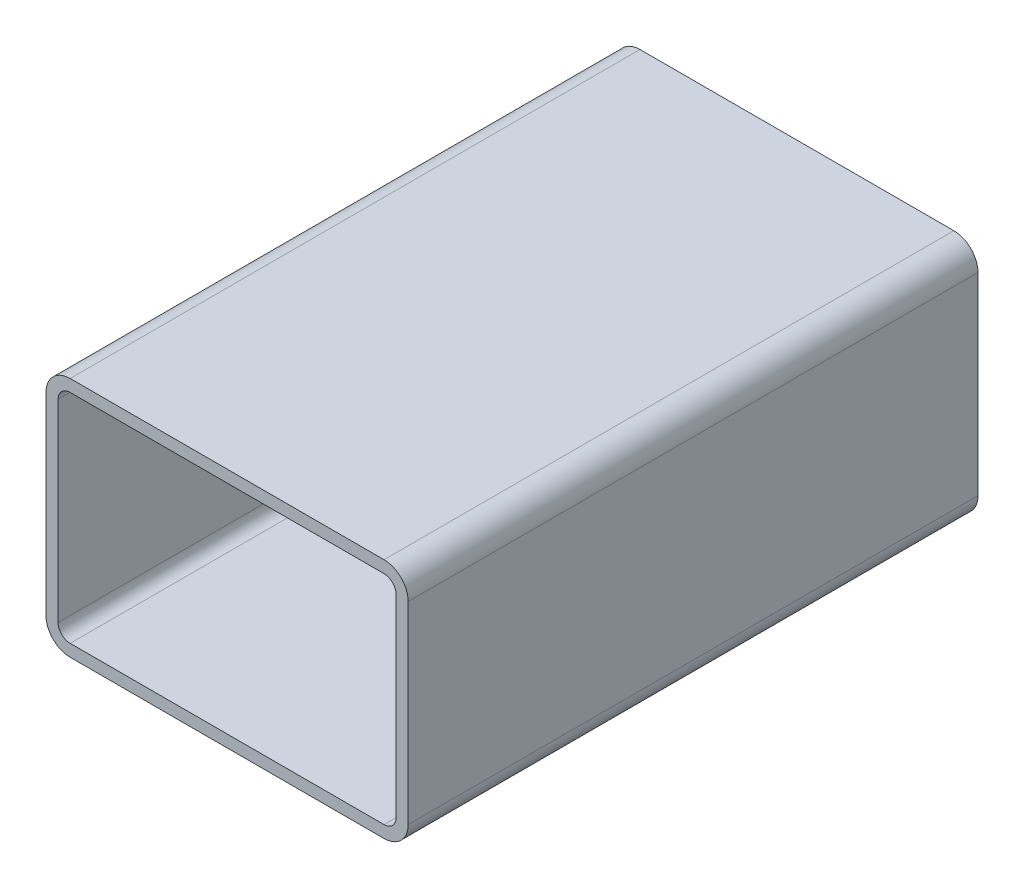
ISO-10303-21;
HEADER;
FILE_DESCRIPTION(('STEP AP214'),'2;1');
FILE_NAME('part.step','',(''),(''),'','','');
FILE_SCHEMA(('AUTOMOTIVE_DESIGN { 1 0 10303 214 1 1 1 1 }'));
ENDSEC;
DATA;
#1=APPLICATION_CONTEXT('core data for automotive mechanical design processes');
#2=APPLICATION_PROTOCOL_DEFINITION('international standard','automotive_design',2000,#1);
#3=PRODUCT_CONTEXT('',#1,'mechanical');
#4=PRODUCT('Part','Part','',(#3));
#5=PRODUCT_RELATED_PRODUCT_CATEGORY('part','',(#4));
#6=PRODUCT_DEFINITION_FORMATION('','',#4);
#7=PRODUCT_DEFINITION_CONTEXT('part definition',#1,'design');
#8=PRODUCT_DEFINITION('design','',#6,#7);
#9=PRODUCT_DEFINITION_SHAPE('','',#8);
#10=(LENGTH_UNIT() NAMED_UNIT(*) SI_UNIT(.MILLI.,.METRE.));
#11=(NAMED_UNIT(*) PLANE_ANGLE_UNIT() SI_UNIT($,.RADIAN.));
#12=(NAMED_UNIT(*) SI_UNIT($,.STERADIAN.) SOLID_ANGLE_UNIT());
#13=UNCERTAINTY_MEASURE_WITH_UNIT(LENGTH_MEASURE(1.E-05),#10,'distance_accuracy_value','');
#14=(GEOMETRIC_REPRESENTATION_CONTEXT(3) GLOBAL_UNCERTAINTY_ASSIGNED_CONTEXT((#13)) GLOBAL_UNIT_ASSIGNED_CONTEXT((#10,
#11,#12)) REPRESENTATION_CONTEXT('',''));
#15=CARTESIAN_POINT('',(0.,0.,0.));
#16=DIRECTION('',(0.,0.,1.));
#17=DIRECTION('',(1.,0.,0.));
#18=AXIS2_PLACEMENT_3D('',#15,#16,#17);
#19=CARTESIAN_POINT('',(20.0000634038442,20.000039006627,236.));
#20=DIRECTION('',(0.,0.,1.));
#21=DIRECTION('',(1.00000000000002,0.,0.));
#22=AXIS2_PLACEMENT_3D('',#19,#20,#21);
#23=PLANE('',#22);
#24=CARTESIAN_POINT('',(20.0000634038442,20.000039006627,236.));
#25=DIRECTION('',(0.,0.,1.));
#26=DIRECTION('',(1.00000000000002,0.,0.));
#27=AXIS2_PLACEMENT_3D('',#24,#25,#26);
#28=CIRCLE('',#27,20.);
#29=CARTESIAN_POINT('',(6.34038417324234E-05,20.0000390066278,236.000000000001));
#30=VERTEX_POINT('',#29);
#31=CARTESIAN_POINT('',(20.0000634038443,3.9006627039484E-05,236.));
#32=VERTEX_POINT('',#31);
#33=EDGE_CURVE('E225',#30,#32,#28,.T.);
#34=ORIENTED_EDGE('',*,*,#33,.T.);
#35=DIRECTION('',(1.00000000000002,0.,0.));
#36=VECTOR('',#35,1.);
#37=CARTESIAN_POINT('',(20.0000634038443,3.9006627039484E-05,236.));
#38=LINE('',#37,#36);
#39=CARTESIAN_POINT('',(280.000063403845,3.90066270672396E-05,236.000000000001));
#40=VERTEX_POINT('',#39);
#41=EDGE_CURVE('E228',#32,#40,#38,.T.);
#42=ORIENTED_EDGE('',*,*,#41,.T.);
#43=CARTESIAN_POINT('',(280.000063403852,20.0000390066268,236.));
#44=DIRECTION('',(0.,0.,1.));
#45=DIRECTION('',(1.00000000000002,0.,0.));
#46=AXIS2_PLACEMENT_3D('',#43,#44,#45);
#47=CIRCLE('',#46,19.9999999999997);
#48=CARTESIAN_POINT('',(300.000063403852,20.0000390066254,236.000000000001));
#49=VERTEX_POINT('',#48);
#50=EDGE_CURVE('E230',#40,#49,#47,.T.);
#51=ORIENTED_EDGE('',*,*,#50,.T.);
#52=DIRECTION('',(0.,0.999999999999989,0.));
#53=VECTOR('',#52,1.);
#54=CARTESIAN_POINT('',(300.000063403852,20.0000390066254,236.000000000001));
#55=LINE('',#54,#53);
#56=CARTESIAN_POINT('',(300.000063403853,180.000039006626,236.));
#57=VERTEX_POINT('',#56);
#58=EDGE_CURVE('E232',#49,#57,#55,.T.);
#59=ORIENTED_EDGE('',*,*,#58,.T.);
#60=CARTESIAN_POINT('',(280.000063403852,180.000039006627,236.));
#61=DIRECTION('',(0.,0.,1.));
#62=DIRECTION('',(1.00000000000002,0.,0.));
#63=AXIS2_PLACEMENT_3D('',#60,#61,#62);
#64=CIRCLE('',#63,20.);
#65=CARTESIAN_POINT('',(280.00006340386,200.000039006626,236.000000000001));
#66=VERTEX_POINT('',#65);
#67=EDGE_CURVE('E234',#57,#66,#64,.T.);
#68=ORIENTED_EDGE('',*,*,#67,.T.);
#69=DIRECTION('',(-1.00000000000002,0.,0.));
#70=VECTOR('',#69,1.);
#71=CARTESIAN_POINT('',(280.000063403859,200.000039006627,236.));
#72=LINE('',#71,#70);
#73=CARTESIAN_POINT('',(20.0000634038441,200.000039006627,236.));
#74=VERTEX_POINT('',#73);
#75=EDGE_CURVE('E236',#66,#74,#72,.T.);
#76=ORIENTED_EDGE('',*,*,#75,.T.);
#77=CARTESIAN_POINT('',(20.0000634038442,180.000039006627,236.));
#78=DIRECTION('',(0.,0.,1.));
#79=DIRECTION('',(1.00000000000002,0.,0.));
#80=AXIS2_PLACEMENT_3D('',#77,#78,#79);
#81=CIRCLE('',#80,20.);
#82=CARTESIAN_POINT('',(6.34038438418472E-05,180.000039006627,236.));
#83=VERTEX_POINT('',#82);
#84=EDGE_CURVE('E238',#74,#83,#81,.T.);
#85=ORIENTED_EDGE('',*,*,#84,.T.);
#86=DIRECTION('',(0.,-0.999999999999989,0.));
#87=VECTOR('',#86,1.);
#88=CARTESIAN_POINT('',(6.34038438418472E-05,180.000039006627,236.));
#89=LINE('',#88,#87);
#90=EDGE_CURVE('E240',#83,#30,#89,.T.);
#91=ORIENTED_EDGE('',*,*,#90,.T.);
#92=EDGE_LOOP('',(#34,#42,#51,#59,#68,#76,#85,#91));
#93=FACE_BOUND('',#92,.T.);
#94=DIRECTION('',(1.00000000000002,0.,0.));
#95=VECTOR('',#94,1.);
#96=CARTESIAN_POINT('',(20.0000634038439,10.0000390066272,236.));
#97=LINE('',#96,#95);
#98=CARTESIAN_POINT('',(20.0000634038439,10.0000390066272,236.));
#99=VERTEX_POINT('',#98);
#100=CARTESIAN_POINT('',(280.000063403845,10.000039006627,236.));
#101=VERTEX_POINT('',#100);
#102=EDGE_CURVE('E183',#99,#101,#97,.T.);
#103=ORIENTED_EDGE('',*,*,#102,.F.);
#104=CARTESIAN_POINT('',(20.0000634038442,20.000039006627,236.));
#105=DIRECTION('',(0.,0.,1.));
#106=DIRECTION('',(1.00000000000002,0.,0.));
#107=AXIS2_PLACEMENT_3D('',#104,#105,#106);
#108=CIRCLE('',#107,10.);
#109=CARTESIAN_POINT('',(10.0000634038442,20.0000390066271,236.));
#110=VERTEX_POINT('',#109);
#111=EDGE_CURVE('E160',#110,#99,#108,.T.);
#112=ORIENTED_EDGE('',*,*,#111,.F.);
#113=DIRECTION('',(0.,-0.999999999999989,0.));
#114=VECTOR('',#113,1.);
#115=CARTESIAN_POINT('',(10.0000634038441,180.000039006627,236.));
#116=LINE('',#115,#114);
#117=CARTESIAN_POINT('',(10.0000634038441,180.000039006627,236.));
#118=VERTEX_POINT('',#117);
#119=EDGE_CURVE('E195',#118,#110,#116,.T.);
#120=ORIENTED_EDGE('',*,*,#119,.F.);
#121=CARTESIAN_POINT('',(20.0000634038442,180.000039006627,236.));
#122=DIRECTION('',(0.,0.,1.));
#123=DIRECTION('',(1.00000000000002,0.,0.));
#124=AXIS2_PLACEMENT_3D('',#121,#122,#123);
#125=CIRCLE('',#124,10.);
#126=CARTESIAN_POINT('',(20.0000634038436,190.000039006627,236.));
#127=VERTEX_POINT('',#126);
#128=EDGE_CURVE('E193',#127,#118,#125,.T.);
#129=ORIENTED_EDGE('',*,*,#128,.F.);
#130=DIRECTION('',(-1.00000000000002,0.,0.));
#131=VECTOR('',#130,1.);
#132=CARTESIAN_POINT('',(280.000063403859,190.000039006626,236.));
#133=LINE('',#132,#131);
#134=CARTESIAN_POINT('',(280.000063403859,190.000039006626,236.));
#135=VERTEX_POINT('',#134);
#136=EDGE_CURVE('E191',#135,#127,#133,.T.);
#137=ORIENTED_EDGE('',*,*,#136,.F.);
#138=CARTESIAN_POINT('',(280.000063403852,180.000039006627,236.));
#139=DIRECTION('',(0.,0.,1.));
#140=DIRECTION('',(1.00000000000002,0.,0.));
#141=AXIS2_PLACEMENT_3D('',#138,#139,#140);
#142=CIRCLE('',#141,10.);
#143=CARTESIAN_POINT('',(290.000063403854,180.000039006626,236.000000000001));
#144=VERTEX_POINT('',#143);
#145=EDGE_CURVE('E189',#144,#135,#142,.T.);
#146=ORIENTED_EDGE('',*,*,#145,.F.);
#147=DIRECTION('',(0.,0.999999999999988,0.));
#148=VECTOR('',#147,1.);
#149=CARTESIAN_POINT('',(290.000063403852,20.0000390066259,236.));
#150=LINE('',#149,#148);
#151=CARTESIAN_POINT('',(290.000063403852,20.0000390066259,236.));
#152=VERTEX_POINT('',#151);
#153=EDGE_CURVE('E187',#152,#144,#150,.T.);
#154=ORIENTED_EDGE('',*,*,#153,.F.);
#155=CARTESIAN_POINT('',(280.000063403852,20.0000390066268,236.));
#156=DIRECTION('',(0.,0.,1.));
#157=DIRECTION('',(1.00000000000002,0.,0.));
#158=AXIS2_PLACEMENT_3D('',#155,#156,#157);
#159=CIRCLE('',#158,9.99999999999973);
#160=EDGE_CURVE('E185',#101,#152,#159,.T.);
#161=ORIENTED_EDGE('',*,*,#160,.F.);
#162=EDGE_LOOP('',(#103,#112,#120,#129,#137,#146,#154,#161));
#163=FACE_BOUND('',#162,.T.);
#164=ADVANCED_FACE('F32',(#93,#163),#23,.T.);
#165=CARTESIAN_POINT('',(20.0000634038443,20.0000390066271,-236.));
#166=DIRECTION('',(0.,0.,1.));
#167=DIRECTION('',(1.00000000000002,0.,0.));
#168=AXIS2_PLACEMENT_3D('',#165,#166,#167);
#169=PLANE('',#168);
#170=CARTESIAN_POINT('',(20.0000634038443,20.0000390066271,-236.));
#171=DIRECTION('',(0.,0.,1.));
#172=DIRECTION('',(1.00000000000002,0.,0.));
#173=AXIS2_PLACEMENT_3D('',#170,#171,#172);
#174=CIRCLE('',#173,20.);
#175=CARTESIAN_POINT('',(6.34038440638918E-05,20.0000390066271,-236.));
#176=VERTEX_POINT('',#175);
#177=CARTESIAN_POINT('',(20.0000634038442,3.9006627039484E-05,-236.));
#178=VERTEX_POINT('',#177);
#179=EDGE_CURVE('E161',#176,#178,#174,.T.);
#180=ORIENTED_EDGE('',*,*,#179,.F.);
#181=DIRECTION('',(0.,-0.999999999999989,0.));
#182=VECTOR('',#181,1.);
#183=CARTESIAN_POINT('',(6.34038442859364E-05,180.000039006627,-236.));
#184=LINE('',#183,#182);
#185=CARTESIAN_POINT('',(6.34038442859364E-05,180.000039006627,-236.));
#186=VERTEX_POINT('',#185);
#187=EDGE_CURVE('E223',#186,#176,#184,.T.);
#188=ORIENTED_EDGE('',*,*,#187,.F.);
#189=CARTESIAN_POINT('',(20.000063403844,180.000039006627,-236.));
#190=DIRECTION('',(0.,0.,1.));
#191=DIRECTION('',(1.00000000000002,0.,0.));
#192=AXIS2_PLACEMENT_3D('',#189,#190,#191);
#193=CIRCLE('',#192,20.);
#194=CARTESIAN_POINT('',(20.0000634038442,200.000039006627,-236.));
#195=VERTEX_POINT('',#194);
#196=EDGE_CURVE('E221',#195,#186,#193,.T.);
#197=ORIENTED_EDGE('',*,*,#196,.F.);
#198=DIRECTION('',(-1.00000000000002,0.,0.));
#199=VECTOR('',#198,1.);
#200=CARTESIAN_POINT('',(280.000063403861,200.000039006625,-236.));
#201=LINE('',#200,#199);
#202=CARTESIAN_POINT('',(280.000063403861,200.000039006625,-236.));
#203=VERTEX_POINT('',#202);
#204=EDGE_CURVE('E219',#203,#195,#201,.T.);
#205=ORIENTED_EDGE('',*,*,#204,.F.);
#206=CARTESIAN_POINT('',(280.000063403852,180.000039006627,-236.));
#207=DIRECTION('',(0.,0.,1.));
#208=DIRECTION('',(1.00000000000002,0.,0.));
#209=AXIS2_PLACEMENT_3D('',#206,#207,#208);
#210=CIRCLE('',#209,20.);
#211=CARTESIAN_POINT('',(300.000063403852,180.000039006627,-236.));
#212=VERTEX_POINT('',#211);
#213=EDGE_CURVE('E217',#212,#203,#210,.T.);
#214=ORIENTED_EDGE('',*,*,#213,.F.);
#215=DIRECTION('',(0.,0.999999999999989,0.));
#216=VECTOR('',#215,1.);
#217=CARTESIAN_POINT('',(300.000063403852,20.0000390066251,-236.));
#218=LINE('',#217,#216);
#219=CARTESIAN_POINT('',(300.000063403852,20.0000390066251,-236.));
#220=VERTEX_POINT('',#219);
#221=EDGE_CURVE('E215',#220,#212,#218,.T.);
#222=ORIENTED_EDGE('',*,*,#221,.F.);
#223=CARTESIAN_POINT('',(280.000063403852,20.0000390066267,-236.));
#224=DIRECTION('',(0.,0.,1.));
#225=DIRECTION('',(1.00000000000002,0.,0.));
#226=AXIS2_PLACEMENT_3D('',#223,#224,#225);
#227=CIRCLE('',#226,19.9999999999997);
#228=CARTESIAN_POINT('',(280.000063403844,3.90066270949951E-05,-236.));
#229=VERTEX_POINT('',#228);
#230=EDGE_CURVE('E213',#229,#220,#227,.T.);
#231=ORIENTED_EDGE('',*,*,#230,.F.);
#232=DIRECTION('',(1.00000000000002,0.,0.));
#233=VECTOR('',#232,1.);
#234=CARTESIAN_POINT('',(20.0000634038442,3.9006627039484E-05,-236.));
#235=LINE('',#234,#233);
#236=EDGE_CURVE('E211',#178,#229,#235,.T.);
#237=ORIENTED_EDGE('',*,*,#236,.F.);
#238=EDGE_LOOP('',(#180,#188,#197,#205,#214,#222,#231,#237));
#239=FACE_BOUND('',#238,.T.);
#240=CARTESIAN_POINT('',(20.0000634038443,20.0000390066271,-236.));
#241=DIRECTION('',(0.,0.,1.));
#242=DIRECTION('',(1.00000000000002,0.,0.));
#243=AXIS2_PLACEMENT_3D('',#240,#241,#242);
#244=CIRCLE('',#243,10.);
#245=CARTESIAN_POINT('',(10.000063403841,20.0000390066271,-235.999999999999));
#246=VERTEX_POINT('',#245);
#247=CARTESIAN_POINT('',(20.0000634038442,10.000039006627,-236.));
#248=VERTEX_POINT('',#247);
#249=EDGE_CURVE('E55',#246,#248,#244,.T.);
#250=ORIENTED_EDGE('',*,*,#249,.T.);
#251=DIRECTION('',(1.00000000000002,0.,0.));
#252=VECTOR('',#251,1.);
#253=CARTESIAN_POINT('',(20.0000634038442,10.000039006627,-236.));
#254=LINE('',#253,#252);
#255=CARTESIAN_POINT('',(280.000063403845,10.0000390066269,-236.));
#256=VERTEX_POINT('',#255);
#257=EDGE_CURVE('E147',#248,#256,#254,.T.);
#258=ORIENTED_EDGE('',*,*,#257,.T.);
#259=CARTESIAN_POINT('',(280.000063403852,20.0000390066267,-236.));
#260=DIRECTION('',(0.,0.,1.));
#261=DIRECTION('',(1.00000000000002,0.,0.));
#262=AXIS2_PLACEMENT_3D('',#259,#260,#261);
#263=CIRCLE('',#262,9.99999999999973);
#264=CARTESIAN_POINT('',(290.000063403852,20.0000390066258,-236.));
#265=VERTEX_POINT('',#264);
#266=EDGE_CURVE('E156',#256,#265,#263,.T.);
#267=ORIENTED_EDGE('',*,*,#266,.T.);
#268=DIRECTION('',(0.,0.999999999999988,0.));
#269=VECTOR('',#268,1.);
#270=CARTESIAN_POINT('',(290.000063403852,20.0000390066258,-236.));
#271=LINE('',#270,#269);
#272=CARTESIAN_POINT('',(290.000063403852,180.000039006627,-236.));
#273=VERTEX_POINT('',#272);
#274=EDGE_CURVE('E170',#265,#273,#271,.T.);
#275=ORIENTED_EDGE('',*,*,#274,.T.);
#276=CARTESIAN_POINT('',(280.000063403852,180.000039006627,-236.));
#277=DIRECTION('',(0.,0.,1.));
#278=DIRECTION('',(1.00000000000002,0.,0.));
#279=AXIS2_PLACEMENT_3D('',#276,#277,#278);
#280=CIRCLE('',#279,10.);
#281=CARTESIAN_POINT('',(280.000063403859,190.000039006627,-236.));
#282=VERTEX_POINT('',#281);
#283=EDGE_CURVE('E173',#273,#282,#280,.T.);
#284=ORIENTED_EDGE('',*,*,#283,.T.);
#285=DIRECTION('',(-1.00000000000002,0.,0.));
#286=VECTOR('',#285,1.);
#287=CARTESIAN_POINT('',(280.000063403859,190.000039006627,-236.));
#288=LINE('',#287,#286);
#289=CARTESIAN_POINT('',(20.0000634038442,190.000039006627,-236.));
#290=VERTEX_POINT('',#289);
#291=EDGE_CURVE('E176',#282,#290,#288,.T.);
#292=ORIENTED_EDGE('',*,*,#291,.T.);
#293=CARTESIAN_POINT('',(20.000063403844,180.000039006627,-236.));
#294=DIRECTION('',(0.,0.,1.));
#295=DIRECTION('',(1.00000000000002,0.,0.));
#296=AXIS2_PLACEMENT_3D('',#293,#294,#295);
#297=CIRCLE('',#296,10.);
#298=CARTESIAN_POINT('',(10.0000634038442,180.000039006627,-236.));
#299=VERTEX_POINT('',#298);
#300=EDGE_CURVE('E179',#290,#299,#297,.T.);
#301=ORIENTED_EDGE('',*,*,#300,.T.);
#302=DIRECTION('',(0.,-0.999999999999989,0.));
#303=VECTOR('',#302,1.);
#304=CARTESIAN_POINT('',(10.0000634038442,180.000039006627,-236.));
#305=LINE('',#304,#303);
#306=EDGE_CURVE('E166',#299,#246,#305,.T.);
#307=ORIENTED_EDGE('',*,*,#306,.T.);
#308=EDGE_LOOP('',(#250,#258,#267,#275,#284,#292,#301,#307));
#309=FACE_BOUND('',#308,.T.);
#310=ADVANCED_FACE('F164',(#239,#309),#169,.F.);
#311=CARTESIAN_POINT('',(20.0000634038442,20.000039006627,236.));
#312=DIRECTION('',(0.,0.,-1.));
#313=DIRECTION('',(-1.00000000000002,0.,0.));
#314=AXIS2_PLACEMENT_3D('',#311,#312,#313);
#315=CYLINDRICAL_SURFACE('',#314,20.);
#316=ORIENTED_EDGE('',*,*,#179,.T.);
#317=DIRECTION('',(0.,0.,-1.));
#318=VECTOR('',#317,1.);
#319=CARTESIAN_POINT('',(20.0000634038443,3.9006627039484E-05,236.));
#320=LINE('',#319,#318);
#321=EDGE_CURVE('E11',#32,#178,#320,.T.);
#322=ORIENTED_EDGE('',*,*,#321,.F.);
#323=ORIENTED_EDGE('',*,*,#33,.F.);
#324=DIRECTION('',(0.,0.,-1.));
#325=VECTOR('',#324,1.);
#326=CARTESIAN_POINT('',(6.34038417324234E-05,20.0000390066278,236.000000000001));
#327=LINE('',#326,#325);
#328=EDGE_CURVE('E242',#30,#176,#327,.T.);
#329=ORIENTED_EDGE('',*,*,#328,.T.);
#330=EDGE_LOOP('',(#316,#322,#323,#329));
#331=FACE_BOUND('',#330,.T.);
#332=ADVANCED_FACE('F34',(#331),#315,.T.);
#333=CARTESIAN_POINT('',(20.0000634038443,3.9006627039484E-05,236.));
#334=DIRECTION('',(0.,0.999999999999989,0.));
#335=DIRECTION('',(0.,0.,1.));
#336=AXIS2_PLACEMENT_3D('',#333,#334,#335);
#337=PLANE('',#336);
#338=ORIENTED_EDGE('',*,*,#236,.T.);
#339=DIRECTION('',(0.,0.,-1.));
#340=VECTOR('',#339,1.);
#341=CARTESIAN_POINT('',(280.000063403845,3.90066270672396E-05,236.000000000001));
#342=LINE('',#341,#340);
#343=EDGE_CURVE('E40',#40,#229,#342,.T.);
#344=ORIENTED_EDGE('',*,*,#343,.F.);
#345=ORIENTED_EDGE('',*,*,#41,.F.);
#346=ORIENTED_EDGE('',*,*,#321,.T.);
#347=EDGE_LOOP('',(#338,#344,#345,#346));
#348=FACE_BOUND('',#347,.T.);
#349=ADVANCED_FACE('F286',(#348),#337,.F.);
#350=CARTESIAN_POINT('',(280.000063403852,20.0000390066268,236.));
#351=DIRECTION('',(0.,0.,-1.));
#352=DIRECTION('',(-1.00000000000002,0.,0.));
#353=AXIS2_PLACEMENT_3D('',#350,#351,#352);
#354=CYLINDRICAL_SURFACE('',#353,19.9999999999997);
#355=ORIENTED_EDGE('',*,*,#230,.T.);
#356=DIRECTION('',(0.,0.,-1.));
#357=VECTOR('',#356,1.);
#358=CARTESIAN_POINT('',(300.000063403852,20.0000390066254,236.000000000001));
#359=LINE('',#358,#357);
#360=EDGE_CURVE('E257',#49,#220,#359,.T.);
#361=ORIENTED_EDGE('',*,*,#360,.F.);
#362=ORIENTED_EDGE('',*,*,#50,.F.);
#363=ORIENTED_EDGE('',*,*,#343,.T.);
#364=EDGE_LOOP('',(#355,#361,#362,#363));
#365=FACE_BOUND('',#364,.T.);
#366=ADVANCED_FACE('F264',(#365),#354,.T.);
#367=CARTESIAN_POINT('',(300.000063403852,20.0000390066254,236.000000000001));
#368=DIRECTION('',(-1.00000000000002,0.,0.));
#369=DIRECTION('',(0.,0.,1.));
#370=AXIS2_PLACEMENT_3D('',#367,#368,#369);
#371=PLANE('',#370);
#372=ORIENTED_EDGE('',*,*,#221,.T.);
#373=DIRECTION('',(0.,0.,-1.));
#374=VECTOR('',#373,1.);
#375=CARTESIAN_POINT('',(300.000063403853,180.000039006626,236.));
#376=LINE('',#375,#374);
#377=EDGE_CURVE('E254',#57,#212,#376,.T.);
#378=ORIENTED_EDGE('',*,*,#377,.F.);
#379=ORIENTED_EDGE('',*,*,#58,.F.);
#380=ORIENTED_EDGE('',*,*,#360,.T.);
#381=EDGE_LOOP('',(#372,#378,#379,#380));
#382=FACE_BOUND('',#381,.T.);
#383=ADVANCED_FACE('F274',(#382),#371,.F.);
#384=CARTESIAN_POINT('',(280.000063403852,180.000039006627,236.));
#385=DIRECTION('',(0.,0.,-1.));
#386=DIRECTION('',(-1.00000000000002,0.,0.));
#387=AXIS2_PLACEMENT_3D('',#384,#385,#386);
#388=CYLINDRICAL_SURFACE('',#387,20.);
#389=ORIENTED_EDGE('',*,*,#213,.T.);
#390=DIRECTION('',(0.,0.,-1.));
#391=VECTOR('',#390,1.);
#392=CARTESIAN_POINT('',(280.00006340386,200.000039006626,236.000000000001));
#393=LINE('',#392,#391);
#394=EDGE_CURVE('E251',#66,#203,#393,.T.);
#395=ORIENTED_EDGE('',*,*,#394,.F.);
#396=ORIENTED_EDGE('',*,*,#67,.F.);
#397=ORIENTED_EDGE('',*,*,#377,.T.);
#398=EDGE_LOOP('',(#389,#395,#396,#397));
#399=FACE_BOUND('',#398,.T.);
#400=ADVANCED_FACE('F278',(#399),#388,.T.);
#401=CARTESIAN_POINT('',(280.000063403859,200.000039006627,236.));
#402=DIRECTION('',(0.,-0.999999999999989,0.));
#403=DIRECTION('',(0.,0.,-1.));
#404=AXIS2_PLACEMENT_3D('',#401,#402,#403);
#405=PLANE('',#404);
#406=ORIENTED_EDGE('',*,*,#204,.T.);
#407=DIRECTION('',(0.,0.,-1.));
#408=VECTOR('',#407,1.);
#409=CARTESIAN_POINT('',(20.0000634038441,200.000039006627,236.));
#410=LINE('',#409,#408);
#411=EDGE_CURVE('E248',#74,#195,#410,.T.);
#412=ORIENTED_EDGE('',*,*,#411,.F.);
#413=ORIENTED_EDGE('',*,*,#75,.F.);
#414=ORIENTED_EDGE('',*,*,#394,.T.);
#415=EDGE_LOOP('',(#406,#412,#413,#414));
#416=FACE_BOUND('',#415,.T.);
#417=ADVANCED_FACE('F299',(#416),#405,.F.);
#418=CARTESIAN_POINT('',(20.0000634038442,180.000039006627,236.));
#419=DIRECTION('',(0.,0.,-1.));
#420=DIRECTION('',(-1.00000000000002,0.,0.));
#421=AXIS2_PLACEMENT_3D('',#418,#419,#420);
#422=CYLINDRICAL_SURFACE('',#421,20.);
#423=ORIENTED_EDGE('',*,*,#196,.T.);
#424=DIRECTION('',(0.,0.,-1.));
#425=VECTOR('',#424,1.);
#426=CARTESIAN_POINT('',(6.34038438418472E-05,180.000039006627,236.));
#427=LINE('',#426,#425);
#428=EDGE_CURVE('E245',#83,#186,#427,.T.);
#429=ORIENTED_EDGE('',*,*,#428,.F.);
#430=ORIENTED_EDGE('',*,*,#84,.F.);
#431=ORIENTED_EDGE('',*,*,#411,.T.);
#432=EDGE_LOOP('',(#423,#429,#430,#431));
#433=FACE_BOUND('',#432,.T.);
#434=ADVANCED_FACE('F297',(#433),#422,.T.);
#435=CARTESIAN_POINT('',(6.34038438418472E-05,180.000039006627,236.));
#436=DIRECTION('',(1.00000000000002,0.,0.));
#437=DIRECTION('',(0.,0.,-1.));
#438=AXIS2_PLACEMENT_3D('',#435,#436,#437);
#439=PLANE('',#438);
#440=ORIENTED_EDGE('',*,*,#187,.T.);
#441=ORIENTED_EDGE('',*,*,#328,.F.);
#442=ORIENTED_EDGE('',*,*,#90,.F.);
#443=ORIENTED_EDGE('',*,*,#428,.T.);
#444=EDGE_LOOP('',(#440,#441,#442,#443));
#445=FACE_BOUND('',#444,.T.);
#446=ADVANCED_FACE('F292',(#445),#439,.F.);
#447=CARTESIAN_POINT('',(20.0000634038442,20.000039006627,236.));
#448=DIRECTION('',(0.,0.,-1.));
#449=DIRECTION('',(-1.00000000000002,0.,0.));
#450=AXIS2_PLACEMENT_3D('',#447,#448,#449);
#451=CYLINDRICAL_SURFACE('',#450,10.);
#452=ORIENTED_EDGE('',*,*,#249,.F.);
#453=DIRECTION('',(0.,0.,-1.));
#454=VECTOR('',#453,1.);
#455=CARTESIAN_POINT('',(10.0000634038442,20.0000390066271,236.));
#456=LINE('',#455,#454);
#457=EDGE_CURVE('E197',#110,#246,#456,.T.);
#458=ORIENTED_EDGE('',*,*,#457,.F.);
#459=ORIENTED_EDGE('',*,*,#111,.T.);
#460=DIRECTION('',(0.,0.,-1.));
#461=VECTOR('',#460,1.);
#462=CARTESIAN_POINT('',(20.0000634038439,10.0000390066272,236.));
#463=LINE('',#462,#461);
#464=EDGE_CURVE('E149',#99,#248,#463,.T.);
#465=ORIENTED_EDGE('',*,*,#464,.T.);
#466=EDGE_LOOP('',(#452,#458,#459,#465));
#467=FACE_BOUND('',#466,.T.);
#468=ADVANCED_FACE('F158',(#467),#451,.F.);
#469=CARTESIAN_POINT('',(20.0000634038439,10.0000390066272,236.));
#470=DIRECTION('',(0.,0.999999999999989,0.));
#471=DIRECTION('',(0.,0.,1.));
#472=AXIS2_PLACEMENT_3D('',#469,#470,#471);
#473=PLANE('',#472);
#474=ORIENTED_EDGE('',*,*,#257,.F.);
#475=ORIENTED_EDGE('',*,*,#464,.F.);
#476=ORIENTED_EDGE('',*,*,#102,.T.);
#477=DIRECTION('',(0.,0.,-1.));
#478=VECTOR('',#477,1.);
#479=CARTESIAN_POINT('',(280.000063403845,10.000039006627,236.));
#480=LINE('',#479,#478);
#481=EDGE_CURVE('E152',#101,#256,#480,.T.);
#482=ORIENTED_EDGE('',*,*,#481,.T.);
#483=EDGE_LOOP('',(#474,#475,#476,#482));
#484=FACE_BOUND('',#483,.T.);
#485=ADVANCED_FACE('F148',(#484),#473,.T.);
#486=CARTESIAN_POINT('',(280.000063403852,20.0000390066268,236.));
#487=DIRECTION('',(0.,0.,-1.));
#488=DIRECTION('',(-1.00000000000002,0.,0.));
#489=AXIS2_PLACEMENT_3D('',#486,#487,#488);
#490=CYLINDRICAL_SURFACE('',#489,9.99999999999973);
#491=ORIENTED_EDGE('',*,*,#266,.F.);
#492=ORIENTED_EDGE('',*,*,#481,.F.);
#493=ORIENTED_EDGE('',*,*,#160,.T.);
#494=DIRECTION('',(0.,0.,-1.));
#495=VECTOR('',#494,1.);
#496=CARTESIAN_POINT('',(290.000063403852,20.0000390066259,236.));
#497=LINE('',#496,#495);
#498=EDGE_CURVE('E206',#152,#265,#497,.T.);
#499=ORIENTED_EDGE('',*,*,#498,.T.);
#500=EDGE_LOOP('',(#491,#492,#493,#499));
#501=FACE_BOUND('',#500,.T.);
#502=ADVANCED_FACE('F323',(#501),#490,.F.);
#503=CARTESIAN_POINT('',(290.000063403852,20.0000390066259,236.));
#504=DIRECTION('',(-1.00000000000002,0.,0.));
#505=DIRECTION('',(0.,-0.999999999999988,0.));
#506=AXIS2_PLACEMENT_3D('',#503,#504,#505);
#507=PLANE('',#506);
#508=ORIENTED_EDGE('',*,*,#274,.F.);
#509=ORIENTED_EDGE('',*,*,#498,.F.);
#510=ORIENTED_EDGE('',*,*,#153,.T.);
#511=DIRECTION('',(0.,0.,-1.));
#512=VECTOR('',#511,1.);
#513=CARTESIAN_POINT('',(290.000063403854,180.000039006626,236.000000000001));
#514=LINE('',#513,#512);
#515=EDGE_CURVE('E204',#144,#273,#514,.T.);
#516=ORIENTED_EDGE('',*,*,#515,.T.);
#517=EDGE_LOOP('',(#508,#509,#510,#516));
#518=FACE_BOUND('',#517,.T.);
#519=ADVANCED_FACE('F328',(#518),#507,.T.);
#520=CARTESIAN_POINT('',(280.000063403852,180.000039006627,236.));
#521=DIRECTION('',(0.,0.,-1.));
#522=DIRECTION('',(-1.00000000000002,0.,0.));
#523=AXIS2_PLACEMENT_3D('',#520,#521,#522);
#524=CYLINDRICAL_SURFACE('',#523,10.);
#525=ORIENTED_EDGE('',*,*,#283,.F.);
#526=ORIENTED_EDGE('',*,*,#515,.F.);
#527=ORIENTED_EDGE('',*,*,#145,.T.);
#528=DIRECTION('',(0.,0.,-1.));
#529=VECTOR('',#528,1.);
#530=CARTESIAN_POINT('',(280.000063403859,190.000039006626,236.));
#531=LINE('',#530,#529);
#532=EDGE_CURVE('E202',#135,#282,#531,.T.);
#533=ORIENTED_EDGE('',*,*,#532,.T.);
#534=EDGE_LOOP('',(#525,#526,#527,#533));
#535=FACE_BOUND('',#534,.T.);
#536=ADVANCED_FACE('F332',(#535),#524,.F.);
#537=CARTESIAN_POINT('',(280.000063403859,190.000039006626,236.));
#538=DIRECTION('',(0.,-0.999999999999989,0.));
#539=DIRECTION('',(0.,0.,-1.));
#540=AXIS2_PLACEMENT_3D('',#537,#538,#539);
#541=PLANE('',#540);
#542=ORIENTED_EDGE('',*,*,#291,.F.);
#543=ORIENTED_EDGE('',*,*,#532,.F.);
#544=ORIENTED_EDGE('',*,*,#136,.T.);
#545=DIRECTION('',(0.,0.,-1.));
#546=VECTOR('',#545,1.);
#547=CARTESIAN_POINT('',(20.0000634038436,190.000039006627,236.));
#548=LINE('',#547,#546);
#549=EDGE_CURVE('E200',#127,#290,#548,.T.);
#550=ORIENTED_EDGE('',*,*,#549,.T.);
#551=EDGE_LOOP('',(#542,#543,#544,#550));
#552=FACE_BOUND('',#551,.T.);
#553=ADVANCED_FACE('F336',(#552),#541,.T.);
#554=CARTESIAN_POINT('',(20.0000634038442,180.000039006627,236.));
#555=DIRECTION('',(0.,0.,-1.));
#556=DIRECTION('',(-1.00000000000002,0.,0.));
#557=AXIS2_PLACEMENT_3D('',#554,#555,#556);
#558=CYLINDRICAL_SURFACE('',#557,10.);
#559=ORIENTED_EDGE('',*,*,#300,.F.);
#560=ORIENTED_EDGE('',*,*,#549,.F.);
#561=ORIENTED_EDGE('',*,*,#128,.T.);
#562=DIRECTION('',(0.,0.,-1.));
#563=VECTOR('',#562,1.);
#564=CARTESIAN_POINT('',(10.0000634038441,180.000039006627,236.));
#565=LINE('',#564,#563);
#566=EDGE_CURVE('E47',#118,#299,#565,.T.);
#567=ORIENTED_EDGE('',*,*,#566,.T.);
#568=EDGE_LOOP('',(#559,#560,#561,#567));
#569=FACE_BOUND('',#568,.T.);
#570=ADVANCED_FACE('F340',(#569),#558,.F.);
#571=CARTESIAN_POINT('',(10.0000634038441,180.000039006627,236.));
#572=DIRECTION('',(1.00000000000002,0.,0.));
#573=DIRECTION('',(0.,0.,-1.));
#574=AXIS2_PLACEMENT_3D('',#571,#572,#573);
#575=PLANE('',#574);
#576=ORIENTED_EDGE('',*,*,#306,.F.);
#577=ORIENTED_EDGE('',*,*,#566,.F.);
#578=ORIENTED_EDGE('',*,*,#119,.T.);
#579=ORIENTED_EDGE('',*,*,#457,.T.);
#580=EDGE_LOOP('',(#576,#577,#578,#579));
#581=FACE_BOUND('',#580,.T.);
#582=ADVANCED_FACE('F344',(#581),#575,.T.);
#583=CLOSED_SHELL('',(#164,#310,#332,#349,#366,#383,#400,#417,#434,#446,#468,#485,#502,#519,
#536,#553,#570,#582));
#584=MANIFOLD_SOLID_BREP('B2',#583);
#585=ADVANCED_BREP_SHAPE_REPRESENTATION('',(#18,#584),#14);
#586=SHAPE_DEFINITION_REPRESENTATION(#9,#585);
ENDSEC;
END-ISO-10303-21;
